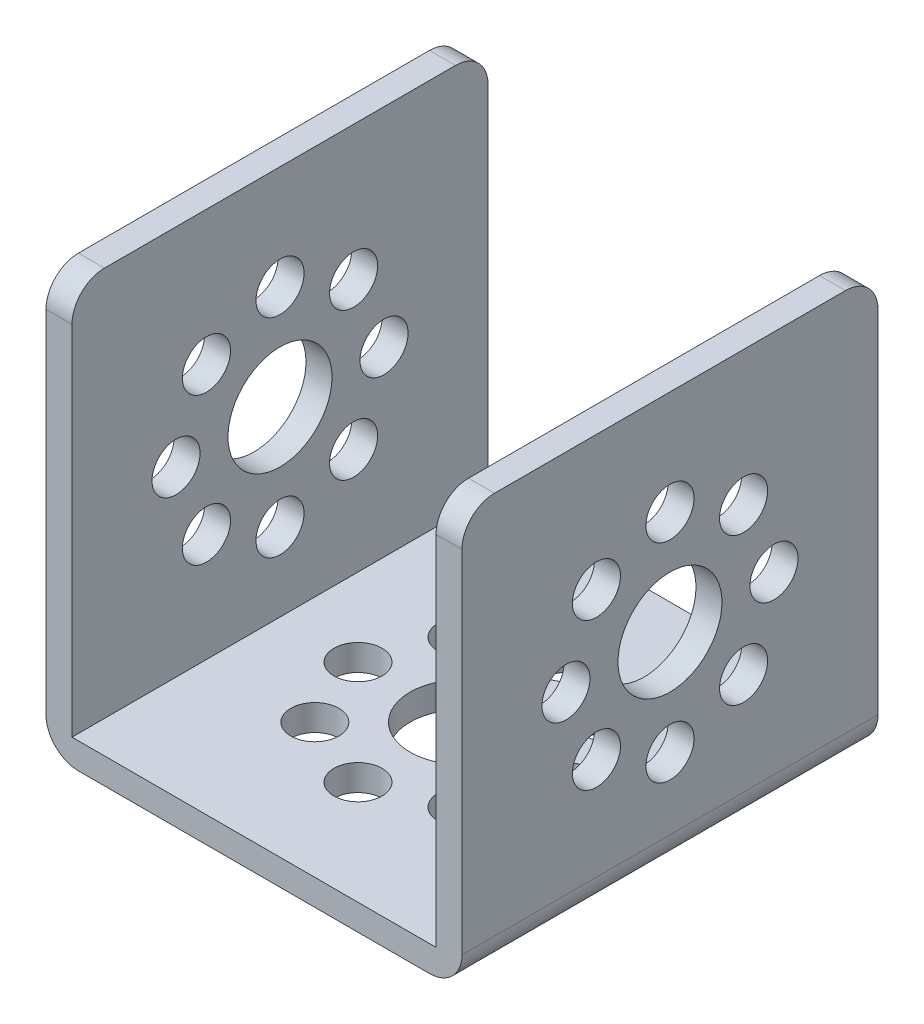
from build123d import *

# Parameters (mm, degrees)
EXTRUDE1_DEPTH     = 32
FILLET1_R          = 2.5
FILLET2_R          = 2.5
FILLET3_R          = 2.5
FILLET4_R          = 2.5
SKETCH5_R          = 4
SKETCH5_R_2        = 1.85
CUT_EXTRUDE1_DEPTH = 32
SKETCH8_R          = 4
SKETCH8_R_2        = 1.85
CUT_EXTRUDE2_DEPTH = 2


with BuildPart() as part:
    # Sketch3 → Extrude1 (new body)
    with BuildSketch(Plane.XY):
        with BuildLine():
            Line((2.5, 0), (29.5, 0))
            ThreePointArc((29.5, 0), (31.267766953, 0.732233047), (32, 2.5))
            Line((32, 2.5), (32, 32))
            Line((32, 32), (30, 32))
            Line((30, 32), (30, 2))
            Line((30, 2), (2, 2))
            Line((2, 2), (2, 32))
            Line((2, 32), (0, 32))
            Line((0, 32), (0, 2.5))
            ThreePointArc((0, 2.5), (0.732233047, 0.732233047), (2.5, 0))
        make_face()
    extrude(amount=EXTRUDE1_DEPTH)

    # Fillet1
    fillet1_edges = [part.edges().sort_by_distance(p)[0] for p in [
        (31, 32, 32),
    ]]
    fillet(fillet1_edges, radius=FILLET1_R)

    # Fillet2
    fillet2_edges = [part.edges().sort_by_distance(p)[0] for p in [
        (1, 32, 32),
    ]]
    fillet(fillet2_edges, radius=FILLET2_R)

    # Fillet3
    fillet3_edges = [part.edges().sort_by_distance(p)[0] for p in [
        (1, 32, 0),
    ]]
    fillet(fillet3_edges, radius=FILLET3_R)

    # Fillet4
    fillet4_edges = [part.edges().sort_by_distance(p)[0] for p in [
        (31, 32, 0),
    ]]
    fillet(fillet4_edges, radius=FILLET4_R)

    # Sketch5 → Cut-Extrude1 (cut)
    with BuildSketch(Plane(origin=(32, 0, 0), x_dir=(0, 0, -1), z_dir=(1, 0, 0))):
        with Locations((-16, 16)):
            Circle(SKETCH5_R)
        with Locations((-16, 8)):
            Circle(SKETCH5_R_2)
        with Locations((-16, 24)):
            Circle(SKETCH5_R_2)
        with Locations((-24, 16)):
            Circle(SKETCH5_R_2)
        with Locations((-8, 16)):
            Circle(SKETCH5_R_2)
        with Locations((-10.34, 21.66)):
            Circle(SKETCH5_R_2)
        with Locations((-21.66, 21.66)):
            Circle(SKETCH5_R_2)
        with Locations((-10.34, 10.34)):
            Circle(SKETCH5_R_2)
        with Locations((-21.66, 10.34)):
            Circle(SKETCH5_R_2)
    extrude(amount=-CUT_EXTRUDE1_DEPTH, mode=Mode.SUBTRACT)

    # Sketch8 → Cut-Extrude2 (cut)
    with BuildSketch(Plane(origin=(0, 2, 0), x_dir=(1, 0, 0), z_dir=(0, 1, 0))):
        with Locations(Location((16, -16, 0), (0, 0, 180))):
            Circle(SKETCH8_R)
        with Locations(Location((24, -16, 0), (0, 0, 180))):
            Circle(SKETCH8_R_2)
        with Locations(Location((8, -16, 0), (0, 0, 180))):
            Circle(SKETCH8_R_2)
        with Locations(Location((16, -8, 0), (0, 0, 180))):
            Circle(SKETCH8_R_2)
        with Locations(Location((16, -24, 0), (0, 0, 180))):
            Circle(SKETCH8_R_2)
        with Locations(Location((21.66, -10.34, 0), (0, 0, 180))):
            Circle(SKETCH8_R_2)
        with Locations(Location((21.66, -21.66, 0), (0, 0, 180))):
            Circle(SKETCH8_R_2)
        with Locations(Location((10.34, -21.66, 0), (0, 0, 180))):
            Circle(SKETCH8_R_2)
        with Locations(Location((10.34, -10.34, 0), (0, 0, 180))):
            Circle(SKETCH8_R_2)
    extrude(amount=-CUT_EXTRUDE2_DEPTH, mode=Mode.SUBTRACT)


solid = part.part
